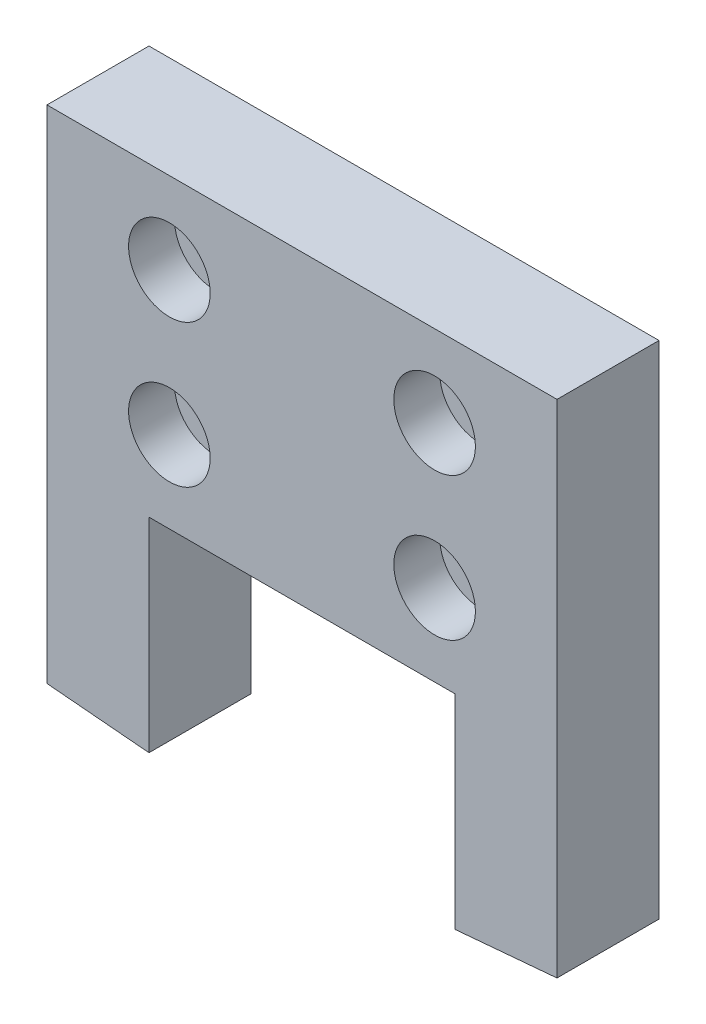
from build123d import *

# Parameters (mm, degrees)
SKETCH_1_R          = 2.25
EXTRUDE_1_DEPTH     = 10
SKETCH_2_R          = 4
CUT_EXTRUDE_1_DEPTH = 4.5


with BuildPart() as part:
    # Sketch 1 → Extrude 1 (new body)
    with BuildSketch(Plane.XY):
        Polygon((0, 50), (50, 50), (50, 0.874886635), (40, 0), (40, 20), (10, 20), (10, 0), (0, 0.874886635), align=None)
        with Locations((12, 42)):
            Circle(SKETCH_1_R, mode=Mode.SUBTRACT)
        with Locations((38, 42)):
            Circle(SKETCH_1_R, mode=Mode.SUBTRACT)
        with Locations((38, 28)):
            Circle(SKETCH_1_R, mode=Mode.SUBTRACT)
        with Locations((12, 28)):
            Circle(SKETCH_1_R, mode=Mode.SUBTRACT)
    extrude(amount=EXTRUDE_1_DEPTH)

    # Sketch 2 → Cut-Extrude 1 (cut)
    with BuildSketch(Plane.XY.offset(10)):
        with Locations((12, 42)):
            Circle(SKETCH_2_R)
        with Locations((38, 42)):
            Circle(SKETCH_2_R)
        with Locations((38, 28)):
            Circle(SKETCH_2_R)
        with Locations((12, 28)):
            Circle(SKETCH_2_R)
    extrude(amount=-CUT_EXTRUDE_1_DEPTH, mode=Mode.SUBTRACT)


solid = part.part
